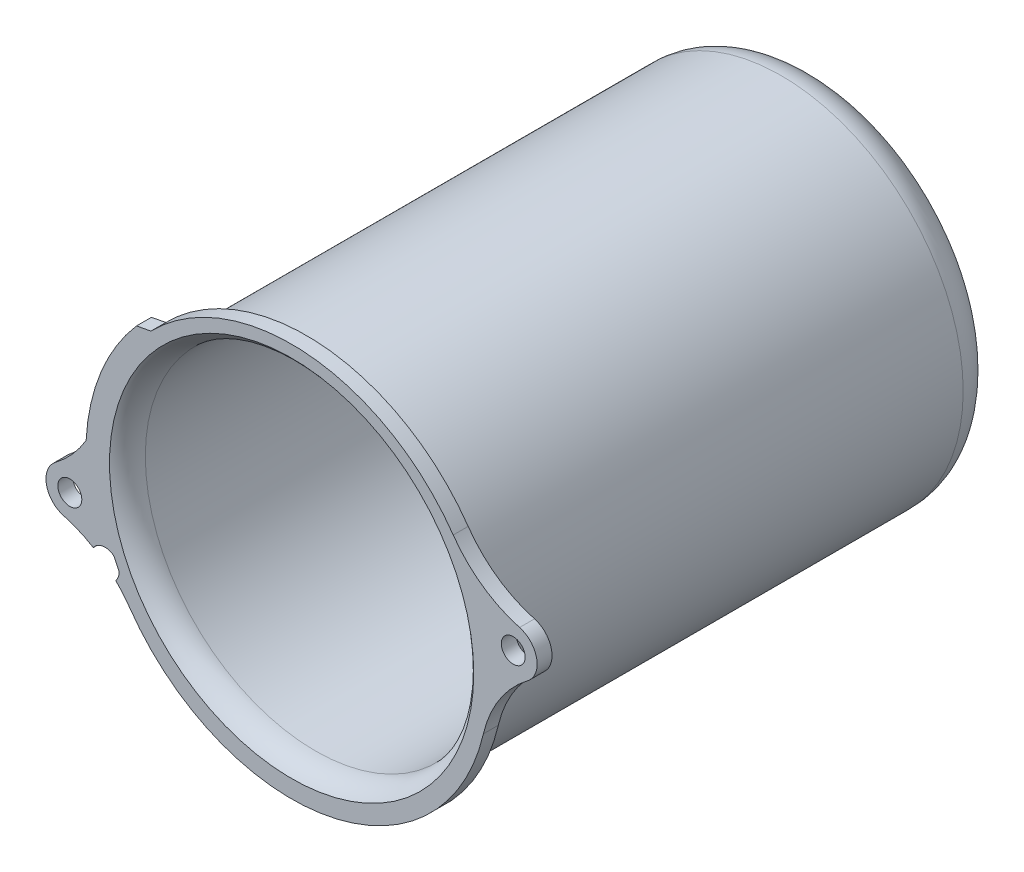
ISO-10303-21;
HEADER;
FILE_DESCRIPTION(('STEP AP214'),'2;1');
FILE_NAME('part.step','',(''),(''),'','','');
FILE_SCHEMA(('AUTOMOTIVE_DESIGN { 1 0 10303 214 1 1 1 1 }'));
ENDSEC;
DATA;
#1=APPLICATION_CONTEXT('core data for automotive mechanical design processes');
#2=APPLICATION_PROTOCOL_DEFINITION('international standard','automotive_design',2000,#1);
#3=PRODUCT_CONTEXT('',#1,'mechanical');
#4=PRODUCT('Part','Part','',(#3));
#5=PRODUCT_RELATED_PRODUCT_CATEGORY('part','',(#4));
#6=PRODUCT_DEFINITION_FORMATION('','',#4);
#7=PRODUCT_DEFINITION_CONTEXT('part definition',#1,'design');
#8=PRODUCT_DEFINITION('design','',#6,#7);
#9=PRODUCT_DEFINITION_SHAPE('','',#8);
#10=(LENGTH_UNIT() NAMED_UNIT(*) SI_UNIT(.MILLI.,.METRE.));
#11=(NAMED_UNIT(*) PLANE_ANGLE_UNIT() SI_UNIT($,.RADIAN.));
#12=(NAMED_UNIT(*) SI_UNIT($,.STERADIAN.) SOLID_ANGLE_UNIT());
#13=UNCERTAINTY_MEASURE_WITH_UNIT(LENGTH_MEASURE(1.E-05),#10,'distance_accuracy_value','');
#14=(GEOMETRIC_REPRESENTATION_CONTEXT(3) GLOBAL_UNCERTAINTY_ASSIGNED_CONTEXT((#13)) GLOBAL_UNIT_ASSIGNED_CONTEXT((#10,
#11,#12)) REPRESENTATION_CONTEXT('',''));
#15=CARTESIAN_POINT('',(0.,0.,0.));
#16=DIRECTION('',(0.,0.,1.));
#17=DIRECTION('',(1.,0.,0.));
#18=AXIS2_PLACEMENT_3D('',#15,#16,#17);
#19=CARTESIAN_POINT('',(37.1314984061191,7.1452296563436,0.));
#20=DIRECTION('',(0.,0.,1.));
#21=DIRECTION('',(1.,0.,0.));
#22=AXIS2_PLACEMENT_3D('',#19,#20,#21);
#23=PLANE('',#22);
#24=CARTESIAN_POINT('',(-37.1557425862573,-7.11096578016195,0.));
#25=DIRECTION('',(0.,0.,-1.));
#26=DIRECTION('',(-1.,0.,0.));
#27=AXIS2_PLACEMENT_3D('',#24,#25,#26);
#28=CIRCLE('',#27,2.);
#29=CARTESIAN_POINT('',(-39.1557425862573,-7.11096578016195,0.));
#30=VERTEX_POINT('',#29);
#31=EDGE_CURVE('E170',#30,#30,#28,.T.);
#32=ORIENTED_EDGE('',*,*,#31,.F.);
#33=EDGE_LOOP('',(#32));
#34=FACE_BOUND('',#33,.T.);
#35=CARTESIAN_POINT('',(37.1314984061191,7.1452296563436,0.));
#36=DIRECTION('',(0.,0.,1.));
#37=DIRECTION('',(1.,0.,0.));
#38=AXIS2_PLACEMENT_3D('',#35,#36,#37);
#39=CIRCLE('',#38,2.);
#40=CARTESIAN_POINT('',(39.1314984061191,7.1452296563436,0.));
#41=VERTEX_POINT('',#40);
#42=EDGE_CURVE('E158',#41,#41,#39,.T.);
#43=ORIENTED_EDGE('',*,*,#42,.T.);
#44=EDGE_LOOP('',(#43));
#45=FACE_BOUND('',#44,.T.);
#46=CARTESIAN_POINT('',(-31.2603609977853,-14.448814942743,0.));
#47=DIRECTION('',(0.,0.,1.));
#48=DIRECTION('',(1.,0.,0.));
#49=AXIS2_PLACEMENT_3D('',#46,#47,#48);
#50=CIRCLE('',#49,2.37047257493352);
#51=CARTESIAN_POINT('',(-29.4766622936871,-16.0100833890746,0.));
#52=VERTEX_POINT('',#51);
#53=CARTESIAN_POINT('',(-28.8900823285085,-14.4184956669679,0.));
#54=VERTEX_POINT('',#53);
#55=EDGE_CURVE('E196',#52,#54,#50,.T.);
#56=ORIENTED_EDGE('',*,*,#55,.T.);
#57=CARTESIAN_POINT('',(0.,0.490000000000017,0.));
#58=DIRECTION('',(0.,0.,1.));
#59=DIRECTION('',(1.,0.,0.));
#60=AXIS2_PLACEMENT_3D('',#57,#58,#59);
#61=CIRCLE('',#60,32.51);
#62=CARTESIAN_POINT('',(-29.7478317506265,-12.6236038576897,0.));
#63=VERTEX_POINT('',#62);
#64=EDGE_CURVE('E155',#63,#54,#61,.T.);
#65=ORIENTED_EDGE('',*,*,#64,.F.);
#66=CARTESIAN_POINT('',(-33.216253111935,-13.1095516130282,0.));
#67=VERTEX_POINT('',#66);
#68=EDGE_CURVE('E48',#63,#67,#50,.T.);
#69=ORIENTED_EDGE('',*,*,#68,.T.);
#70=CARTESIAN_POINT('',(-43.517994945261,-30.2523085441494,0.));
#71=DIRECTION('',(0.,0.,-1.));
#72=DIRECTION('',(-1.,0.,0.));
#73=AXIS2_PLACEMENT_3D('',#70,#71,#72);
#74=CIRCLE('',#73,20.);
#75=CARTESIAN_POINT('',(-38.2161179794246,-10.9678562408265,0.));
#76=VERTEX_POINT('',#75);
#77=EDGE_CURVE('E195',#76,#67,#74,.T.);
#78=ORIENTED_EDGE('',*,*,#77,.F.);
#79=CARTESIAN_POINT('',(-37.1557425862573,-7.11096578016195,0.));
#80=DIRECTION('',(0.,0.,-1.));
#81=DIRECTION('',(-1.,0.,0.));
#82=AXIS2_PLACEMENT_3D('',#79,#80,#81);
#83=CIRCLE('',#82,4.00000000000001);
#84=CARTESIAN_POINT('',(-39.5685318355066,-3.9205977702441,0.));
#85=VERTEX_POINT('',#84);
#86=EDGE_CURVE('E192',#76,#85,#83,.T.);
#87=ORIENTED_EDGE('',*,*,#86,.T.);
#88=CARTESIAN_POINT('',(-51.632478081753,12.0312422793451,0.));
#89=DIRECTION('',(0.,0.,1.));
#90=DIRECTION('',(1.,0.,0.));
#91=AXIS2_PLACEMENT_3D('',#88,#89,#90);
#92=CIRCLE('',#91,20.);
#93=CARTESIAN_POINT('',(-34.4270577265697,1.83450209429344,0.));
#94=VERTEX_POINT('',#93);
#95=EDGE_CURVE('E189',#85,#94,#92,.T.);
#96=ORIENTED_EDGE('',*,*,#95,.T.);
#97=CARTESIAN_POINT('',(-0.0121220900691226,0.0171319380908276,0.));
#98=DIRECTION('',(0.,0.,1.));
#99=DIRECTION('',(1.,0.,0.));
#100=AXIS2_PLACEMENT_3D('',#97,#98,#99);
#101=CIRCLE('',#100,34.4628877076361);
#102=CARTESIAN_POINT('',(-25.9858462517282,22.667877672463,0.));
#103=VERTEX_POINT('',#102);
#104=EDGE_CURVE('E186',#103,#94,#101,.T.);
#105=ORIENTED_EDGE('',*,*,#104,.F.);
#106=DIRECTION('',(-0.982414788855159,-0.186711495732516,0.));
#107=VECTOR('',#106,1.);
#108=CARTESIAN_POINT('',(-23.568944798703,23.1272185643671,0.));
#109=LINE('',#108,#107);
#110=CARTESIAN_POINT('',(-23.568944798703,23.1272185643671,0.));
#111=VERTEX_POINT('',#110);
#112=EDGE_CURVE('E183',#111,#103,#109,.T.);
#113=ORIENTED_EDGE('',*,*,#112,.F.);
#114=CARTESIAN_POINT('',(-0.0121220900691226,0.0171319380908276,0.));
#115=DIRECTION('',(0.,0.,1.));
#116=DIRECTION('',(1.,0.,0.));
#117=AXIS2_PLACEMENT_3D('',#114,#115,#116);
#118=CIRCLE('',#117,33.);
#119=CARTESIAN_POINT('',(27.0764402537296,18.8641420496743,0.));
#120=VERTEX_POINT('',#119);
#121=EDGE_CURVE('E182',#120,#111,#118,.T.);
#122=ORIENTED_EDGE('',*,*,#121,.F.);
#123=CARTESIAN_POINT('',(43.4937507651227,30.286572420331,0.));
#124=DIRECTION('',(0.,0.,-1.));
#125=DIRECTION('',(-1.,0.,0.));
#126=AXIS2_PLACEMENT_3D('',#123,#124,#125);
#127=CIRCLE('',#126,20.);
#128=CARTESIAN_POINT('',(38.1918737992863,11.0021201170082,0.));
#129=VERTEX_POINT('',#128);
#130=EDGE_CURVE('E179',#129,#120,#127,.T.);
#131=ORIENTED_EDGE('',*,*,#130,.F.);
#132=CARTESIAN_POINT('',(37.1314984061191,7.1452296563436,0.));
#133=DIRECTION('',(0.,0.,1.));
#134=DIRECTION('',(1.,0.,0.));
#135=AXIS2_PLACEMENT_3D('',#132,#133,#134);
#136=CIRCLE('',#135,4.00000000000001);
#137=CARTESIAN_POINT('',(39.5442876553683,3.95486164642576,0.));
#138=VERTEX_POINT('',#137);
#139=EDGE_CURVE('E176',#138,#129,#136,.T.);
#140=ORIENTED_EDGE('',*,*,#139,.F.);
#141=CARTESIAN_POINT('',(51.6082339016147,-11.9969784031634,0.));
#142=DIRECTION('',(0.,0.,1.));
#143=DIRECTION('',(1.,0.,0.));
#144=AXIS2_PLACEMENT_3D('',#141,#142,#143);
#145=CIRCLE('',#144,20.);
#146=CARTESIAN_POINT('',(32.1288542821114,-7.46335185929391,0.));
#147=VERTEX_POINT('',#146);
#148=EDGE_CURVE('E204',#138,#147,#145,.T.);
#149=ORIENTED_EDGE('',*,*,#148,.T.);
#150=CARTESIAN_POINT('',(-27.1006844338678,-18.8298781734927,0.));
#151=VERTEX_POINT('',#150);
#152=EDGE_CURVE('E201',#151,#147,#118,.T.);
#153=ORIENTED_EDGE('',*,*,#152,.F.);
#154=EDGE_CURVE('E198',#52,#151,#74,.T.);
#155=ORIENTED_EDGE('',*,*,#154,.F.);
#156=EDGE_LOOP('',(#56,#65,#69,#78,#87,#96,#105,#113,#122,#131,#140,#149,#153,#155));
#157=FACE_BOUND('',#156,.T.);
#158=CARTESIAN_POINT('',(0.,0.490000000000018,0.));
#159=DIRECTION('',(0.,0.,1.));
#160=DIRECTION('',(1.,0.,0.));
#161=AXIS2_PLACEMENT_3D('',#158,#159,#160);
#162=CIRCLE('',#161,32.01);
#163=CARTESIAN_POINT('',(32.01,0.490000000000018,0.));
#164=VERTEX_POINT('',#163);
#165=EDGE_CURVE('E11',#164,#164,#162,.F.);
#166=ORIENTED_EDGE('',*,*,#165,.F.);
#167=EDGE_LOOP('',(#166));
#168=FACE_BOUND('',#167,.T.);
#169=ADVANCED_FACE('F33',(#34,#45,#157,#168),#23,.F.);
#170=CARTESIAN_POINT('',(-31.2603609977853,-14.448814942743,2.5));
#171=DIRECTION('',(0.,0.,-1.));
#172=DIRECTION('',(-1.,0.,0.));
#173=AXIS2_PLACEMENT_3D('',#170,#171,#172);
#174=CYLINDRICAL_SURFACE('',#173,2.37047257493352);
#175=CARTESIAN_POINT('',(-31.2603609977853,-14.448814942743,2.5));
#176=DIRECTION('',(0.,0.,1.));
#177=DIRECTION('',(1.,0.,0.));
#178=AXIS2_PLACEMENT_3D('',#175,#176,#177);
#179=CIRCLE('',#178,2.37047257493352);
#180=CARTESIAN_POINT('',(-29.4766622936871,-16.0100833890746,2.5));
#181=VERTEX_POINT('',#180);
#182=CARTESIAN_POINT('',(-28.8900823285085,-14.4184956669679,2.5));
#183=VERTEX_POINT('',#182);
#184=EDGE_CURVE('E145',#181,#183,#179,.T.);
#185=ORIENTED_EDGE('',*,*,#184,.T.);
#186=DIRECTION('',(0.,0.,1.));
#187=VECTOR('',#186,1.);
#188=CARTESIAN_POINT('',(-28.8900823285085,-14.4184956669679,1.24999999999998));
#189=LINE('',#188,#187);
#190=EDGE_CURVE('E41',#183,#54,#189,.F.);
#191=ORIENTED_EDGE('',*,*,#190,.T.);
#192=ORIENTED_EDGE('',*,*,#55,.F.);
#193=DIRECTION('',(0.,0.,-1.));
#194=VECTOR('',#193,1.);
#195=CARTESIAN_POINT('',(-29.4766622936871,-16.0100833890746,2.5));
#196=LINE('',#195,#194);
#197=EDGE_CURVE('E241',#181,#52,#196,.T.);
#198=ORIENTED_EDGE('',*,*,#197,.F.);
#199=EDGE_LOOP('',(#185,#191,#192,#198));
#200=FACE_BOUND('',#199,.T.);
#201=ADVANCED_FACE('F287',(#200),#174,.F.);
#202=ORIENTED_EDGE('',*,*,#68,.F.);
#203=DIRECTION('',(0.,0.,1.));
#204=VECTOR('',#203,1.);
#205=CARTESIAN_POINT('',(-29.7478317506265,-12.6236038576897,1.24999999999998));
#206=LINE('',#205,#204);
#207=CARTESIAN_POINT('',(-29.7478317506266,-12.6236038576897,2.49999999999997));
#208=VERTEX_POINT('',#207);
#209=EDGE_CURVE('E147',#63,#208,#206,.T.);
#210=ORIENTED_EDGE('',*,*,#209,.T.);
#211=CARTESIAN_POINT('',(-33.216253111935,-13.1095516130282,2.5));
#212=VERTEX_POINT('',#211);
#213=EDGE_CURVE('E135',#208,#212,#179,.T.);
#214=ORIENTED_EDGE('',*,*,#213,.T.);
#215=DIRECTION('',(0.,0.,-1.));
#216=VECTOR('',#215,1.);
#217=CARTESIAN_POINT('',(-33.216253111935,-13.1095516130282,2.5));
#218=LINE('',#217,#216);
#219=EDGE_CURVE('E243',#212,#67,#218,.T.);
#220=ORIENTED_EDGE('',*,*,#219,.T.);
#221=EDGE_LOOP('',(#202,#210,#214,#220));
#222=FACE_BOUND('',#221,.T.);
#223=ADVANCED_FACE('F148',(#222),#174,.F.);
#224=CARTESIAN_POINT('',(37.1314984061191,7.1452296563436,2.5));
#225=DIRECTION('',(0.,0.,1.));
#226=DIRECTION('',(1.,0.,0.));
#227=AXIS2_PLACEMENT_3D('',#224,#225,#226);
#228=PLANE('',#227);
#229=CARTESIAN_POINT('',(0.,0.490000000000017,2.49999999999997));
#230=DIRECTION('',(0.,0.,1.));
#231=DIRECTION('',(1.,0.,0.));
#232=AXIS2_PLACEMENT_3D('',#229,#230,#231);
#233=CIRCLE('',#232,32.51);
#234=EDGE_CURVE('E140',#208,#183,#233,.T.);
#235=ORIENTED_EDGE('',*,*,#234,.T.);
#236=ORIENTED_EDGE('',*,*,#184,.F.);
#237=CARTESIAN_POINT('',(-43.517994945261,-30.2523085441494,2.5));
#238=DIRECTION('',(0.,0.,-1.));
#239=DIRECTION('',(-1.,0.,0.));
#240=AXIS2_PLACEMENT_3D('',#237,#238,#239);
#241=CIRCLE('',#240,20.);
#242=CARTESIAN_POINT('',(-27.1006844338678,-18.8298781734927,2.5));
#243=VERTEX_POINT('',#242);
#244=EDGE_CURVE('E226',#181,#243,#241,.T.);
#245=ORIENTED_EDGE('',*,*,#244,.T.);
#246=CARTESIAN_POINT('',(-0.0121220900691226,0.0171319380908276,2.5));
#247=DIRECTION('',(0.,0.,1.));
#248=DIRECTION('',(1.,0.,0.));
#249=AXIS2_PLACEMENT_3D('',#246,#247,#248);
#250=CIRCLE('',#249,33.);
#251=CARTESIAN_POINT('',(32.1288542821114,-7.46335185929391,2.5));
#252=VERTEX_POINT('',#251);
#253=EDGE_CURVE('E229',#243,#252,#250,.T.);
#254=ORIENTED_EDGE('',*,*,#253,.T.);
#255=CARTESIAN_POINT('',(51.6082339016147,-11.9969784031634,2.5));
#256=DIRECTION('',(0.,0.,1.));
#257=DIRECTION('',(1.,0.,0.));
#258=AXIS2_PLACEMENT_3D('',#255,#256,#257);
#259=CIRCLE('',#258,20.);
#260=CARTESIAN_POINT('',(39.5442876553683,3.95486164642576,2.5));
#261=VERTEX_POINT('',#260);
#262=EDGE_CURVE('E232',#261,#252,#259,.T.);
#263=ORIENTED_EDGE('',*,*,#262,.F.);
#264=CARTESIAN_POINT('',(37.1314984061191,7.1452296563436,2.5));
#265=DIRECTION('',(0.,0.,1.));
#266=DIRECTION('',(1.,0.,0.));
#267=AXIS2_PLACEMENT_3D('',#264,#265,#266);
#268=CIRCLE('',#267,4.00000000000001);
#269=CARTESIAN_POINT('',(38.1918737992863,11.0021201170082,2.5));
#270=VERTEX_POINT('',#269);
#271=EDGE_CURVE('E207',#261,#270,#268,.T.);
#272=ORIENTED_EDGE('',*,*,#271,.T.);
#273=CARTESIAN_POINT('',(43.4937507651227,30.286572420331,2.5));
#274=DIRECTION('',(0.,0.,-1.));
#275=DIRECTION('',(-1.,0.,0.));
#276=AXIS2_PLACEMENT_3D('',#273,#274,#275);
#277=CIRCLE('',#276,20.);
#278=CARTESIAN_POINT('',(27.0764402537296,18.8641420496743,2.5));
#279=VERTEX_POINT('',#278);
#280=EDGE_CURVE('E210',#270,#279,#277,.T.);
#281=ORIENTED_EDGE('',*,*,#280,.T.);
#282=CARTESIAN_POINT('',(-23.568944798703,23.1272185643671,2.5));
#283=VERTEX_POINT('',#282);
#284=EDGE_CURVE('E213',#279,#283,#250,.T.);
#285=ORIENTED_EDGE('',*,*,#284,.T.);
#286=DIRECTION('',(-0.982414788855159,-0.186711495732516,0.));
#287=VECTOR('',#286,1.);
#288=CARTESIAN_POINT('',(-23.568944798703,23.1272185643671,2.5));
#289=LINE('',#288,#287);
#290=CARTESIAN_POINT('',(-25.9858462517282,22.667877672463,2.5));
#291=VERTEX_POINT('',#290);
#292=EDGE_CURVE('E214',#283,#291,#289,.T.);
#293=ORIENTED_EDGE('',*,*,#292,.T.);
#294=CARTESIAN_POINT('',(-0.0121220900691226,0.0171319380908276,2.5));
#295=DIRECTION('',(0.,0.,1.));
#296=DIRECTION('',(1.,0.,0.));
#297=AXIS2_PLACEMENT_3D('',#294,#295,#296);
#298=CIRCLE('',#297,34.4628877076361);
#299=CARTESIAN_POINT('',(-34.4270577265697,1.83450209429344,2.5));
#300=VERTEX_POINT('',#299);
#301=EDGE_CURVE('E217',#291,#300,#298,.T.);
#302=ORIENTED_EDGE('',*,*,#301,.T.);
#303=CARTESIAN_POINT('',(-51.632478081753,12.0312422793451,2.5));
#304=DIRECTION('',(0.,0.,1.));
#305=DIRECTION('',(1.,0.,0.));
#306=AXIS2_PLACEMENT_3D('',#303,#304,#305);
#307=CIRCLE('',#306,20.);
#308=CARTESIAN_POINT('',(-39.5685318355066,-3.9205977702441,2.5));
#309=VERTEX_POINT('',#308);
#310=EDGE_CURVE('E220',#309,#300,#307,.T.);
#311=ORIENTED_EDGE('',*,*,#310,.F.);
#312=CARTESIAN_POINT('',(-37.1557425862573,-7.11096578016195,2.5));
#313=DIRECTION('',(0.,0.,-1.));
#314=DIRECTION('',(-1.,0.,0.));
#315=AXIS2_PLACEMENT_3D('',#312,#313,#314);
#316=CIRCLE('',#315,4.00000000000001);
#317=CARTESIAN_POINT('',(-38.2161179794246,-10.9678562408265,2.5));
#318=VERTEX_POINT('',#317);
#319=EDGE_CURVE('E223',#318,#309,#316,.T.);
#320=ORIENTED_EDGE('',*,*,#319,.F.);
#321=EDGE_CURVE('E143',#318,#212,#241,.T.);
#322=ORIENTED_EDGE('',*,*,#321,.T.);
#323=ORIENTED_EDGE('',*,*,#213,.F.);
#324=EDGE_LOOP('',(#235,#236,#245,#254,#263,#272,#281,#285,#293,#302,#311,#320,#322,#323));
#325=FACE_BOUND('',#324,.T.);
#326=CARTESIAN_POINT('',(0.,0.490000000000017,2.49999999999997));
#327=DIRECTION('',(0.,0.,1.));
#328=DIRECTION('',(1.,0.,0.));
#329=AXIS2_PLACEMENT_3D('',#326,#327,#328);
#330=CIRCLE('',#329,30.51);
#331=CARTESIAN_POINT('',(30.51,0.490000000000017,2.49999999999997));
#332=VERTEX_POINT('',#331);
#333=EDGE_CURVE('E156',#332,#332,#330,.T.);
#334=ORIENTED_EDGE('',*,*,#333,.F.);
#335=EDGE_LOOP('',(#334));
#336=FACE_BOUND('',#335,.T.);
#337=CARTESIAN_POINT('',(-37.1557425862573,-7.11096578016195,2.5));
#338=DIRECTION('',(0.,0.,-1.));
#339=DIRECTION('',(-1.,0.,0.));
#340=AXIS2_PLACEMENT_3D('',#337,#338,#339);
#341=CIRCLE('',#340,2.);
#342=CARTESIAN_POINT('',(-39.1557425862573,-7.11096578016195,2.5));
#343=VERTEX_POINT('',#342);
#344=EDGE_CURVE('E173',#343,#343,#341,.T.);
#345=ORIENTED_EDGE('',*,*,#344,.T.);
#346=EDGE_LOOP('',(#345));
#347=FACE_BOUND('',#346,.T.);
#348=CARTESIAN_POINT('',(37.1314984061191,7.1452296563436,2.5));
#349=DIRECTION('',(0.,0.,1.));
#350=DIRECTION('',(1.,0.,0.));
#351=AXIS2_PLACEMENT_3D('',#348,#349,#350);
#352=CIRCLE('',#351,2.);
#353=CARTESIAN_POINT('',(39.1314984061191,7.1452296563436,2.5));
#354=VERTEX_POINT('',#353);
#355=EDGE_CURVE('E167',#354,#354,#352,.T.);
#356=ORIENTED_EDGE('',*,*,#355,.F.);
#357=EDGE_LOOP('',(#356));
#358=FACE_BOUND('',#357,.T.);
#359=ADVANCED_FACE('F136',(#325,#336,#347,#358),#228,.T.);
#360=CARTESIAN_POINT('',(37.1314984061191,7.1452296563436,2.5));
#361=DIRECTION('',(0.,0.,-1.));
#362=DIRECTION('',(-1.,0.,0.));
#363=AXIS2_PLACEMENT_3D('',#360,#361,#362);
#364=CYLINDRICAL_SURFACE('',#363,4.00000000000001);
#365=DIRECTION('',(0.,0.,-1.));
#366=VECTOR('',#365,1.);
#367=CARTESIAN_POINT('',(38.1918737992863,11.0021201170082,2.5));
#368=LINE('',#367,#366);
#369=EDGE_CURVE('E152',#270,#129,#368,.T.);
#370=ORIENTED_EDGE('',*,*,#369,.F.);
#371=ORIENTED_EDGE('',*,*,#271,.F.);
#372=DIRECTION('',(0.,0.,-1.));
#373=VECTOR('',#372,1.);
#374=CARTESIAN_POINT('',(39.5442876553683,3.95486164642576,2.5));
#375=LINE('',#374,#373);
#376=EDGE_CURVE('E235',#261,#138,#375,.T.);
#377=ORIENTED_EDGE('',*,*,#376,.T.);
#378=ORIENTED_EDGE('',*,*,#139,.T.);
#379=EDGE_LOOP('',(#370,#371,#377,#378));
#380=FACE_BOUND('',#379,.T.);
#381=ADVANCED_FACE('F264',(#380),#364,.T.);
#382=CARTESIAN_POINT('',(43.4937507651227,30.286572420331,2.5));
#383=DIRECTION('',(0.,0.,-1.));
#384=DIRECTION('',(-1.,0.,0.));
#385=AXIS2_PLACEMENT_3D('',#382,#383,#384);
#386=CYLINDRICAL_SURFACE('',#385,20.);
#387=DIRECTION('',(0.,0.,-1.));
#388=VECTOR('',#387,1.);
#389=CARTESIAN_POINT('',(27.0764402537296,18.8641420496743,2.5));
#390=LINE('',#389,#388);
#391=EDGE_CURVE('E255',#279,#120,#390,.T.);
#392=ORIENTED_EDGE('',*,*,#391,.F.);
#393=ORIENTED_EDGE('',*,*,#280,.F.);
#394=ORIENTED_EDGE('',*,*,#369,.T.);
#395=ORIENTED_EDGE('',*,*,#130,.T.);
#396=EDGE_LOOP('',(#392,#393,#394,#395));
#397=FACE_BOUND('',#396,.T.);
#398=ADVANCED_FACE('F35',(#397),#386,.F.);
#399=CARTESIAN_POINT('',(-0.0121220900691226,0.0171319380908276,2.5));
#400=DIRECTION('',(0.,0.,-1.));
#401=DIRECTION('',(-1.,0.,0.));
#402=AXIS2_PLACEMENT_3D('',#399,#400,#401);
#403=CYLINDRICAL_SURFACE('',#402,33.);
#404=DIRECTION('',(0.,0.,-1.));
#405=VECTOR('',#404,1.);
#406=CARTESIAN_POINT('',(-23.568944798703,23.1272185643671,2.5));
#407=LINE('',#406,#405);
#408=EDGE_CURVE('E253',#283,#111,#407,.T.);
#409=ORIENTED_EDGE('',*,*,#408,.F.);
#410=ORIENTED_EDGE('',*,*,#284,.F.);
#411=ORIENTED_EDGE('',*,*,#391,.T.);
#412=ORIENTED_EDGE('',*,*,#121,.T.);
#413=EDGE_LOOP('',(#409,#410,#411,#412));
#414=FACE_BOUND('',#413,.T.);
#415=ADVANCED_FACE('F272',(#414),#403,.T.);
#416=CARTESIAN_POINT('',(-23.568944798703,23.1272185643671,2.5));
#417=DIRECTION('',(0.186711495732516,-0.982414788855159,0.));
#418=DIRECTION('',(0.982414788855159,0.186711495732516,0.));
#419=AXIS2_PLACEMENT_3D('',#416,#417,#418);
#420=PLANE('',#419);
#421=DIRECTION('',(0.,0.,-1.));
#422=VECTOR('',#421,1.);
#423=CARTESIAN_POINT('',(-25.9858462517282,22.667877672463,2.5));
#424=LINE('',#423,#422);
#425=EDGE_CURVE('E251',#291,#103,#424,.T.);
#426=ORIENTED_EDGE('',*,*,#425,.F.);
#427=ORIENTED_EDGE('',*,*,#292,.F.);
#428=ORIENTED_EDGE('',*,*,#408,.T.);
#429=ORIENTED_EDGE('',*,*,#112,.T.);
#430=EDGE_LOOP('',(#426,#427,#428,#429));
#431=FACE_BOUND('',#430,.T.);
#432=ADVANCED_FACE('F303',(#431),#420,.F.);
#433=CARTESIAN_POINT('',(-0.0121220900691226,0.0171319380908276,2.5));
#434=DIRECTION('',(0.,0.,-1.));
#435=DIRECTION('',(-1.,0.,0.));
#436=AXIS2_PLACEMENT_3D('',#433,#434,#435);
#437=CYLINDRICAL_SURFACE('',#436,34.4628877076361);
#438=DIRECTION('',(0.,0.,-1.));
#439=VECTOR('',#438,1.);
#440=CARTESIAN_POINT('',(-34.4270577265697,1.83450209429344,2.5));
#441=LINE('',#440,#439);
#442=EDGE_CURVE('E249',#300,#94,#441,.T.);
#443=ORIENTED_EDGE('',*,*,#442,.F.);
#444=ORIENTED_EDGE('',*,*,#301,.F.);
#445=ORIENTED_EDGE('',*,*,#425,.T.);
#446=ORIENTED_EDGE('',*,*,#104,.T.);
#447=EDGE_LOOP('',(#443,#444,#445,#446));
#448=FACE_BOUND('',#447,.T.);
#449=ADVANCED_FACE('F301',(#448),#437,.T.);
#450=CARTESIAN_POINT('',(-51.632478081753,12.0312422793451,2.5));
#451=DIRECTION('',(0.,0.,-1.));
#452=DIRECTION('',(-1.,0.,0.));
#453=AXIS2_PLACEMENT_3D('',#450,#451,#452);
#454=CYLINDRICAL_SURFACE('',#453,20.);
#455=DIRECTION('',(0.,0.,-1.));
#456=VECTOR('',#455,1.);
#457=CARTESIAN_POINT('',(-39.5685318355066,-3.9205977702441,2.5));
#458=LINE('',#457,#456);
#459=EDGE_CURVE('E247',#309,#85,#458,.T.);
#460=ORIENTED_EDGE('',*,*,#459,.F.);
#461=ORIENTED_EDGE('',*,*,#310,.T.);
#462=ORIENTED_EDGE('',*,*,#442,.T.);
#463=ORIENTED_EDGE('',*,*,#95,.F.);
#464=EDGE_LOOP('',(#460,#461,#462,#463));
#465=FACE_BOUND('',#464,.T.);
#466=ADVANCED_FACE('F297',(#465),#454,.F.);
#467=CARTESIAN_POINT('',(-37.1557425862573,-7.11096578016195,2.5));
#468=DIRECTION('',(0.,0.,-1.));
#469=DIRECTION('',(-1.,0.,0.));
#470=AXIS2_PLACEMENT_3D('',#467,#468,#469);
#471=CYLINDRICAL_SURFACE('',#470,4.00000000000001);
#472=DIRECTION('',(0.,0.,-1.));
#473=VECTOR('',#472,1.);
#474=CARTESIAN_POINT('',(-38.2161179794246,-10.9678562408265,2.5));
#475=LINE('',#474,#473);
#476=EDGE_CURVE('E245',#318,#76,#475,.T.);
#477=ORIENTED_EDGE('',*,*,#476,.F.);
#478=ORIENTED_EDGE('',*,*,#319,.T.);
#479=ORIENTED_EDGE('',*,*,#459,.T.);
#480=ORIENTED_EDGE('',*,*,#86,.F.);
#481=EDGE_LOOP('',(#477,#478,#479,#480));
#482=FACE_BOUND('',#481,.T.);
#483=ADVANCED_FACE('F294',(#482),#471,.T.);
#484=CARTESIAN_POINT('',(-43.517994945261,-30.2523085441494,2.5));
#485=DIRECTION('',(0.,0.,-1.));
#486=DIRECTION('',(-1.,0.,0.));
#487=AXIS2_PLACEMENT_3D('',#484,#485,#486);
#488=CYLINDRICAL_SURFACE('',#487,20.);
#489=ORIENTED_EDGE('',*,*,#219,.F.);
#490=ORIENTED_EDGE('',*,*,#321,.F.);
#491=ORIENTED_EDGE('',*,*,#476,.T.);
#492=ORIENTED_EDGE('',*,*,#77,.T.);
#493=EDGE_LOOP('',(#489,#490,#491,#492));
#494=FACE_BOUND('',#493,.T.);
#495=ADVANCED_FACE('F291',(#494),#488,.F.);
#496=DIRECTION('',(0.,0.,-1.));
#497=VECTOR('',#496,1.);
#498=CARTESIAN_POINT('',(-27.1006844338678,-18.8298781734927,2.5));
#499=LINE('',#498,#497);
#500=EDGE_CURVE('E239',#243,#151,#499,.T.);
#501=ORIENTED_EDGE('',*,*,#500,.F.);
#502=ORIENTED_EDGE('',*,*,#244,.F.);
#503=ORIENTED_EDGE('',*,*,#197,.T.);
#504=ORIENTED_EDGE('',*,*,#154,.T.);
#505=EDGE_LOOP('',(#501,#502,#503,#504));
#506=FACE_BOUND('',#505,.T.);
#507=ADVANCED_FACE('F286',(#506),#488,.F.);
#508=DIRECTION('',(0.,0.,-1.));
#509=VECTOR('',#508,1.);
#510=CARTESIAN_POINT('',(32.1288542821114,-7.46335185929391,2.5));
#511=LINE('',#510,#509);
#512=EDGE_CURVE('E237',#252,#147,#511,.T.);
#513=ORIENTED_EDGE('',*,*,#512,.F.);
#514=ORIENTED_EDGE('',*,*,#253,.F.);
#515=ORIENTED_EDGE('',*,*,#500,.T.);
#516=ORIENTED_EDGE('',*,*,#152,.T.);
#517=EDGE_LOOP('',(#513,#514,#515,#516));
#518=FACE_BOUND('',#517,.T.);
#519=ADVANCED_FACE('F283',(#518),#403,.T.);
#520=CARTESIAN_POINT('',(51.6082339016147,-11.9969784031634,2.5));
#521=DIRECTION('',(0.,0.,-1.));
#522=DIRECTION('',(-1.,0.,0.));
#523=AXIS2_PLACEMENT_3D('',#520,#521,#522);
#524=CYLINDRICAL_SURFACE('',#523,20.);
#525=ORIENTED_EDGE('',*,*,#262,.T.);
#526=ORIENTED_EDGE('',*,*,#512,.T.);
#527=ORIENTED_EDGE('',*,*,#148,.F.);
#528=ORIENTED_EDGE('',*,*,#376,.F.);
#529=EDGE_LOOP('',(#525,#526,#527,#528));
#530=FACE_BOUND('',#529,.T.);
#531=ADVANCED_FACE('F279',(#530),#524,.F.);
#532=CARTESIAN_POINT('',(-37.1557425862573,-7.11096578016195,2.5));
#533=DIRECTION('',(0.,0.,-1.));
#534=DIRECTION('',(-1.,0.,0.));
#535=AXIS2_PLACEMENT_3D('',#532,#533,#534);
#536=CYLINDRICAL_SURFACE('',#535,2.);
#537=ORIENTED_EDGE('',*,*,#344,.F.);
#538=EDGE_LOOP('',(#537));
#539=FACE_BOUND('',#538,.T.);
#540=ORIENTED_EDGE('',*,*,#31,.T.);
#541=EDGE_LOOP('',(#540));
#542=FACE_BOUND('',#541,.T.);
#543=ADVANCED_FACE('F322',(#539,#542),#536,.F.);
#544=CARTESIAN_POINT('',(37.1314984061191,7.1452296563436,2.5));
#545=DIRECTION('',(0.,0.,-1.));
#546=DIRECTION('',(-1.,0.,0.));
#547=AXIS2_PLACEMENT_3D('',#544,#545,#546);
#548=CYLINDRICAL_SURFACE('',#547,2.);
#549=ORIENTED_EDGE('',*,*,#355,.T.);
#550=EDGE_LOOP('',(#549));
#551=FACE_BOUND('',#550,.T.);
#552=ORIENTED_EDGE('',*,*,#42,.F.);
#553=EDGE_LOOP('',(#552));
#554=FACE_BOUND('',#553,.T.);
#555=ADVANCED_FACE('F367',(#551,#554),#548,.F.);
#556=CARTESIAN_POINT('',(0.,0.490000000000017,-0.231281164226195));
#557=DIRECTION('',(0.,0.,1.));
#558=DIRECTION('',(1.,0.,0.));
#559=AXIS2_PLACEMENT_3D('',#556,#557,#558);
#560=CYLINDRICAL_SURFACE('',#559,30.5099999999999);
#561=CARTESIAN_POINT('',(0.,0.490000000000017,-79.4999999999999));
#562=DIRECTION('',(0.,0.,1.));
#563=DIRECTION('',(1.,0.,0.));
#564=AXIS2_PLACEMENT_3D('',#561,#562,#563);
#565=CIRCLE('',#564,30.51);
#566=CARTESIAN_POINT('',(30.51,0.490000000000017,-79.4999999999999));
#567=VERTEX_POINT('',#566);
#568=EDGE_CURVE('E644',#567,#567,#565,.T.);
#569=ORIENTED_EDGE('',*,*,#568,.T.);
#570=EDGE_LOOP('',(#569));
#571=FACE_BOUND('',#570,.T.);
#572=CARTESIAN_POINT('',(0.,0.490000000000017,-1.49999999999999));
#573=DIRECTION('',(0.,0.,1.));
#574=DIRECTION('',(1.,0.,0.));
#575=AXIS2_PLACEMENT_3D('',#572,#573,#574);
#576=CIRCLE('',#575,30.5099999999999);
#577=CARTESIAN_POINT('',(30.5099999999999,0.490000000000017,-1.49999999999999));
#578=VERTEX_POINT('',#577);
#579=EDGE_CURVE('E641',#578,#578,#576,.T.);
#580=ORIENTED_EDGE('',*,*,#579,.F.);
#581=EDGE_LOOP('',(#580));
#582=FACE_BOUND('',#581,.T.);
#583=ADVANCED_FACE('F374',(#571,#582),#560,.T.);
#584=CARTESIAN_POINT('',(0.,0.490000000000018,-79.5));
#585=DIRECTION('',(0.,0.,1.));
#586=DIRECTION('',(1.,0.,0.));
#587=AXIS2_PLACEMENT_3D('',#584,#585,#586);
#588=TOROIDAL_SURFACE('',#587,24.5099999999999,6.);
#589=ORIENTED_EDGE('',*,*,#568,.F.);
#590=EDGE_LOOP('',(#589));
#591=FACE_BOUND('',#590,.T.);
#592=CARTESIAN_POINT('',(0.,0.490000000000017,-85.5));
#593=DIRECTION('',(0.,0.,1.));
#594=DIRECTION('',(1.,0.,0.));
#595=AXIS2_PLACEMENT_3D('',#592,#593,#594);
#596=CIRCLE('',#595,24.5099999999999);
#597=CARTESIAN_POINT('',(24.5099999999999,0.490000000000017,-85.5));
#598=VERTEX_POINT('',#597);
#599=EDGE_CURVE('E647',#598,#598,#596,.T.);
#600=ORIENTED_EDGE('',*,*,#599,.T.);
#601=EDGE_LOOP('',(#600));
#602=FACE_BOUND('',#601,.T.);
#603=ADVANCED_FACE('F381',(#591,#602),#588,.T.);
#604=CARTESIAN_POINT('',(0.,24.9999999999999,-85.5));
#605=DIRECTION('',(0.,0.,-1.));
#606=DIRECTION('',(-1.,0.,0.));
#607=AXIS2_PLACEMENT_3D('',#604,#605,#606);
#608=PLANE('',#607);
#609=CARTESIAN_POINT('',(0.,0.490000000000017,-85.5));
#610=DIRECTION('',(0.,0.,1.));
#611=DIRECTION('',(1.,0.,0.));
#612=AXIS2_PLACEMENT_3D('',#609,#610,#611);
#613=CIRCLE('',#612,13.01);
#614=CARTESIAN_POINT('',(13.01,0.490000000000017,-85.5));
#615=VERTEX_POINT('',#614);
#616=EDGE_CURVE('E652',#615,#615,#613,.T.);
#617=ORIENTED_EDGE('',*,*,#616,.T.);
#618=EDGE_LOOP('',(#617));
#619=FACE_BOUND('',#618,.T.);
#620=ORIENTED_EDGE('',*,*,#599,.F.);
#621=EDGE_LOOP('',(#620));
#622=FACE_BOUND('',#621,.T.);
#623=ADVANCED_FACE('F389',(#619,#622),#608,.T.);
#624=CARTESIAN_POINT('',(0.,0.490000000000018,-86.5));
#625=DIRECTION('',(0.,0.,1.));
#626=DIRECTION('',(1.,0.,0.));
#627=AXIS2_PLACEMENT_3D('',#624,#625,#626);
#628=TOROIDAL_SURFACE('',#627,13.01,0.999999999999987);
#629=ORIENTED_EDGE('',*,*,#616,.F.);
#630=EDGE_LOOP('',(#629));
#631=FACE_BOUND('',#630,.T.);
#632=CARTESIAN_POINT('',(0.,0.490000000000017,-86.5));
#633=DIRECTION('',(0.,0.,1.));
#634=DIRECTION('',(1.,0.,0.));
#635=AXIS2_PLACEMENT_3D('',#632,#633,#634);
#636=CIRCLE('',#635,12.01);
#637=CARTESIAN_POINT('',(12.01,0.490000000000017,-86.5));
#638=VERTEX_POINT('',#637);
#639=EDGE_CURVE('E655',#638,#638,#636,.T.);
#640=ORIENTED_EDGE('',*,*,#639,.T.);
#641=EDGE_LOOP('',(#640));
#642=FACE_BOUND('',#641,.T.);
#643=ADVANCED_FACE('F397',(#631,#642),#628,.F.);
#644=CARTESIAN_POINT('',(0.,0.490000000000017,-0.231281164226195));
#645=DIRECTION('',(0.,0.,1.));
#646=DIRECTION('',(1.,0.,0.));
#647=AXIS2_PLACEMENT_3D('',#644,#645,#646);
#648=CYLINDRICAL_SURFACE('',#647,12.01);
#649=CARTESIAN_POINT('',(0.,0.490000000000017,-90.4999999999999));
#650=DIRECTION('',(0.,0.,1.));
#651=DIRECTION('',(1.,0.,0.));
#652=AXIS2_PLACEMENT_3D('',#649,#650,#651);
#653=CIRCLE('',#652,12.01);
#654=CARTESIAN_POINT('',(12.01,0.490000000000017,-90.4999999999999));
#655=VERTEX_POINT('',#654);
#656=EDGE_CURVE('E658',#655,#655,#653,.T.);
#657=ORIENTED_EDGE('',*,*,#656,.T.);
#658=EDGE_LOOP('',(#657));
#659=FACE_BOUND('',#658,.T.);
#660=ORIENTED_EDGE('',*,*,#639,.F.);
#661=EDGE_LOOP('',(#660));
#662=FACE_BOUND('',#661,.T.);
#663=ADVANCED_FACE('F405',(#659,#662),#648,.T.);
#664=CARTESIAN_POINT('',(0.,0.490000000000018,-90.5));
#665=DIRECTION('',(0.,0.,1.));
#666=DIRECTION('',(1.,0.,0.));
#667=AXIS2_PLACEMENT_3D('',#664,#665,#666);
#668=TOROIDAL_SURFACE('',#667,8.00999999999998,3.99999999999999);
#669=ORIENTED_EDGE('',*,*,#656,.F.);
#670=EDGE_LOOP('',(#669));
#671=FACE_BOUND('',#670,.T.);
#672=CARTESIAN_POINT('',(0.,0.490000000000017,-94.5));
#673=DIRECTION('',(0.,0.,1.));
#674=DIRECTION('',(1.,0.,0.));
#675=AXIS2_PLACEMENT_3D('',#672,#673,#674);
#676=CIRCLE('',#675,8.00999999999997);
#677=CARTESIAN_POINT('',(8.00999999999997,0.490000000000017,-94.5));
#678=VERTEX_POINT('',#677);
#679=EDGE_CURVE('E661',#678,#678,#676,.T.);
#680=ORIENTED_EDGE('',*,*,#679,.T.);
#681=EDGE_LOOP('',(#680));
#682=FACE_BOUND('',#681,.T.);
#683=ADVANCED_FACE('F413',(#671,#682),#668,.T.);
#684=CARTESIAN_POINT('',(0.,8.49999999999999,-94.5));
#685=DIRECTION('',(0.,0.,-1.));
#686=DIRECTION('',(-1.,0.,0.));
#687=AXIS2_PLACEMENT_3D('',#684,#685,#686);
#688=PLANE('',#687);
#689=CARTESIAN_POINT('',(0.,0.490000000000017,-94.4999999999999));
#690=DIRECTION('',(0.,0.,1.));
#691=DIRECTION('',(1.,0.,0.));
#692=AXIS2_PLACEMENT_3D('',#689,#690,#691);
#693=CIRCLE('',#692,0.00999999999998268);
#694=CARTESIAN_POINT('',(0.00999999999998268,0.490000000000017,-94.4999999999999));
#695=VERTEX_POINT('',#694);
#696=EDGE_CURVE('E664',#695,#695,#693,.T.);
#697=ORIENTED_EDGE('',*,*,#696,.T.);
#698=EDGE_LOOP('',(#697));
#699=FACE_BOUND('',#698,.T.);
#700=ORIENTED_EDGE('',*,*,#679,.F.);
#701=EDGE_LOOP('',(#700));
#702=FACE_BOUND('',#701,.T.);
#703=ADVANCED_FACE('F421',(#699,#702),#688,.T.);
#704=CARTESIAN_POINT('',(0.,0.490000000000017,-0.231281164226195));
#705=DIRECTION('',(0.,0.,1.));
#706=DIRECTION('',(1.,0.,0.));
#707=AXIS2_PLACEMENT_3D('',#704,#705,#706);
#708=CYLINDRICAL_SURFACE('',#707,0.00999999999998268);
#709=CARTESIAN_POINT('',(0.,0.490000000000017,-92.5));
#710=DIRECTION('',(0.,0.,1.));
#711=DIRECTION('',(1.,0.,0.));
#712=AXIS2_PLACEMENT_3D('',#709,#710,#711);
#713=CIRCLE('',#712,0.00999999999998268);
#714=CARTESIAN_POINT('',(0.00999999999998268,0.490000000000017,-92.5));
#715=VERTEX_POINT('',#714);
#716=EDGE_CURVE('E667',#715,#715,#713,.T.);
#717=ORIENTED_EDGE('',*,*,#716,.T.);
#718=EDGE_LOOP('',(#717));
#719=FACE_BOUND('',#718,.T.);
#720=ORIENTED_EDGE('',*,*,#696,.F.);
#721=EDGE_LOOP('',(#720));
#722=FACE_BOUND('',#721,.T.);
#723=ADVANCED_FACE('F429',(#719,#722),#708,.F.);
#724=CARTESIAN_POINT('',(0.,8.5,-92.5));
#725=DIRECTION('',(0.,0.,-1.));
#726=DIRECTION('',(-1.,0.,0.));
#727=AXIS2_PLACEMENT_3D('',#724,#725,#726);
#728=PLANE('',#727);
#729=ORIENTED_EDGE('',*,*,#716,.F.);
#730=EDGE_LOOP('',(#729));
#731=FACE_BOUND('',#730,.T.);
#732=CARTESIAN_POINT('',(0.,0.490000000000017,-92.5));
#733=DIRECTION('',(0.,0.,1.));
#734=DIRECTION('',(1.,0.,0.));
#735=AXIS2_PLACEMENT_3D('',#732,#733,#734);
#736=CIRCLE('',#735,8.00999999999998);
#737=CARTESIAN_POINT('',(8.00999999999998,0.490000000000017,-92.5));
#738=VERTEX_POINT('',#737);
#739=EDGE_CURVE('E670',#738,#738,#736,.T.);
#740=ORIENTED_EDGE('',*,*,#739,.T.);
#741=EDGE_LOOP('',(#740));
#742=FACE_BOUND('',#741,.T.);
#743=ADVANCED_FACE('F437',(#731,#742),#728,.F.);
#744=CARTESIAN_POINT('',(0.,0.490000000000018,-90.5));
#745=DIRECTION('',(0.,0.,1.));
#746=DIRECTION('',(1.,0.,0.));
#747=AXIS2_PLACEMENT_3D('',#744,#745,#746);
#748=TOROIDAL_SURFACE('',#747,8.00999999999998,2.00000000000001);
#749=CARTESIAN_POINT('',(0.,0.490000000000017,-91.5));
#750=DIRECTION('',(0.,0.,1.));
#751=DIRECTION('',(1.,0.,0.));
#752=AXIS2_PLACEMENT_3D('',#749,#750,#751);
#753=CIRCLE('',#752,9.74205080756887);
#754=CARTESIAN_POINT('',(9.74205080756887,0.490000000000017,-91.5));
#755=VERTEX_POINT('',#754);
#756=EDGE_CURVE('E673',#755,#755,#753,.T.);
#757=ORIENTED_EDGE('',*,*,#756,.T.);
#758=EDGE_LOOP('',(#757));
#759=FACE_BOUND('',#758,.T.);
#760=ORIENTED_EDGE('',*,*,#739,.F.);
#761=EDGE_LOOP('',(#760));
#762=FACE_BOUND('',#761,.T.);
#763=ADVANCED_FACE('F445',(#759,#762),#748,.F.);
#764=CARTESIAN_POINT('',(0.,10.2320508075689,-91.5));
#765=DIRECTION('',(0.,0.,1.));
#766=DIRECTION('',(1.,0.,0.));
#767=AXIS2_PLACEMENT_3D('',#764,#765,#766);
#768=PLANE('',#767);
#769=CARTESIAN_POINT('',(0.,0.490000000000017,-91.5));
#770=DIRECTION('',(0.,0.,1.));
#771=DIRECTION('',(1.,0.,0.));
#772=AXIS2_PLACEMENT_3D('',#769,#770,#771);
#773=CIRCLE('',#772,10.51);
#774=CARTESIAN_POINT('',(10.51,0.490000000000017,-91.5));
#775=VERTEX_POINT('',#774);
#776=EDGE_CURVE('E676',#775,#775,#773,.T.);
#777=ORIENTED_EDGE('',*,*,#776,.T.);
#778=EDGE_LOOP('',(#777));
#779=FACE_BOUND('',#778,.T.);
#780=ORIENTED_EDGE('',*,*,#756,.F.);
#781=EDGE_LOOP('',(#780));
#782=FACE_BOUND('',#781,.T.);
#783=ADVANCED_FACE('F453',(#779,#782),#768,.T.);
#784=CARTESIAN_POINT('',(0.,0.490000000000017,-0.231281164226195));
#785=DIRECTION('',(0.,0.,1.));
#786=DIRECTION('',(1.,0.,0.));
#787=AXIS2_PLACEMENT_3D('',#784,#785,#786);
#788=CYLINDRICAL_SURFACE('',#787,10.51);
#789=CARTESIAN_POINT('',(0.,0.490000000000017,-84.8416876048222));
#790=DIRECTION('',(0.,0.,1.));
#791=DIRECTION('',(1.,0.,0.));
#792=AXIS2_PLACEMENT_3D('',#789,#790,#791);
#793=CIRCLE('',#792,10.51);
#794=CARTESIAN_POINT('',(10.51,0.490000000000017,-84.8416876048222));
#795=VERTEX_POINT('',#794);
#796=EDGE_CURVE('E679',#795,#795,#793,.T.);
#797=ORIENTED_EDGE('',*,*,#796,.T.);
#798=EDGE_LOOP('',(#797));
#799=FACE_BOUND('',#798,.T.);
#800=ORIENTED_EDGE('',*,*,#776,.F.);
#801=EDGE_LOOP('',(#800));
#802=FACE_BOUND('',#801,.T.);
#803=ADVANCED_FACE('F461',(#799,#802),#788,.F.);
#804=CARTESIAN_POINT('',(0.,0.490000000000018,-86.5));
#805=DIRECTION('',(0.,0.,1.));
#806=DIRECTION('',(1.,0.,0.));
#807=AXIS2_PLACEMENT_3D('',#804,#805,#806);
#808=TOROIDAL_SURFACE('',#807,13.01,3.00000000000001);
#809=ORIENTED_EDGE('',*,*,#796,.F.);
#810=EDGE_LOOP('',(#809));
#811=FACE_BOUND('',#810,.T.);
#812=CARTESIAN_POINT('',(0.,0.490000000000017,-83.5));
#813=DIRECTION('',(0.,0.,1.));
#814=DIRECTION('',(1.,0.,0.));
#815=AXIS2_PLACEMENT_3D('',#812,#813,#814);
#816=CIRCLE('',#815,13.01);
#817=CARTESIAN_POINT('',(13.01,0.490000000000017,-83.5));
#818=VERTEX_POINT('',#817);
#819=EDGE_CURVE('E682',#818,#818,#816,.T.);
#820=ORIENTED_EDGE('',*,*,#819,.T.);
#821=EDGE_LOOP('',(#820));
#822=FACE_BOUND('',#821,.T.);
#823=ADVANCED_FACE('F469',(#811,#822),#808,.T.);
#824=CARTESIAN_POINT('',(0.,25.,-83.5));
#825=DIRECTION('',(0.,0.,-1.));
#826=DIRECTION('',(-1.,0.,0.));
#827=AXIS2_PLACEMENT_3D('',#824,#825,#826);
#828=PLANE('',#827);
#829=ORIENTED_EDGE('',*,*,#819,.F.);
#830=EDGE_LOOP('',(#829));
#831=FACE_BOUND('',#830,.T.);
#832=CARTESIAN_POINT('',(0.,0.490000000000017,-83.5));
#833=DIRECTION('',(0.,0.,1.));
#834=DIRECTION('',(1.,0.,0.));
#835=AXIS2_PLACEMENT_3D('',#832,#833,#834);
#836=CIRCLE('',#835,24.51);
#837=CARTESIAN_POINT('',(24.51,0.490000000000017,-83.5));
#838=VERTEX_POINT('',#837);
#839=EDGE_CURVE('E685',#838,#838,#836,.T.);
#840=ORIENTED_EDGE('',*,*,#839,.T.);
#841=EDGE_LOOP('',(#840));
#842=FACE_BOUND('',#841,.T.);
#843=ADVANCED_FACE('F477',(#831,#842),#828,.F.);
#844=CARTESIAN_POINT('',(0.,0.490000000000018,-79.5));
#845=DIRECTION('',(0.,0.,1.));
#846=DIRECTION('',(1.,0.,0.));
#847=AXIS2_PLACEMENT_3D('',#844,#845,#846);
#848=TOROIDAL_SURFACE('',#847,24.51,4.);
#849=CARTESIAN_POINT('',(0.,0.490000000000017,-79.5));
#850=DIRECTION('',(0.,0.,1.));
#851=DIRECTION('',(1.,0.,0.));
#852=AXIS2_PLACEMENT_3D('',#849,#850,#851);
#853=CIRCLE('',#852,28.51);
#854=CARTESIAN_POINT('',(28.51,0.490000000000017,-79.5));
#855=VERTEX_POINT('',#854);
#856=EDGE_CURVE('E688',#855,#855,#853,.T.);
#857=ORIENTED_EDGE('',*,*,#856,.T.);
#858=EDGE_LOOP('',(#857));
#859=FACE_BOUND('',#858,.T.);
#860=ORIENTED_EDGE('',*,*,#839,.F.);
#861=EDGE_LOOP('',(#860));
#862=FACE_BOUND('',#861,.T.);
#863=ADVANCED_FACE('F485',(#859,#862),#848,.F.);
#864=CARTESIAN_POINT('',(0.,0.490000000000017,-0.231281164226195));
#865=DIRECTION('',(0.,0.,1.));
#866=DIRECTION('',(1.,0.,0.));
#867=AXIS2_PLACEMENT_3D('',#864,#865,#866);
#868=CYLINDRICAL_SURFACE('',#867,28.51);
#869=ORIENTED_EDGE('',*,*,#856,.F.);
#870=EDGE_LOOP('',(#869));
#871=FACE_BOUND('',#870,.T.);
#872=CARTESIAN_POINT('',(0.,0.490000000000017,-1.5));
#873=DIRECTION('',(0.,0.,1.));
#874=DIRECTION('',(1.,0.,0.));
#875=AXIS2_PLACEMENT_3D('',#872,#873,#874);
#876=CIRCLE('',#875,28.51);
#877=CARTESIAN_POINT('',(28.51,0.490000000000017,-1.5));
#878=VERTEX_POINT('',#877);
#879=EDGE_CURVE('E161',#878,#878,#876,.T.);
#880=ORIENTED_EDGE('',*,*,#879,.T.);
#881=EDGE_LOOP('',(#880));
#882=FACE_BOUND('',#881,.T.);
#883=ADVANCED_FACE('F493',(#871,#882),#868,.F.);
#884=CARTESIAN_POINT('',(0.,0.490000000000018,-1.5));
#885=DIRECTION('',(0.,0.,1.));
#886=DIRECTION('',(1.,0.,0.));
#887=AXIS2_PLACEMENT_3D('',#884,#885,#886);
#888=TOROIDAL_SURFACE('',#887,33.51,5.);
#889=ORIENTED_EDGE('',*,*,#879,.F.);
#890=EDGE_LOOP('',(#889));
#891=FACE_BOUND('',#890,.T.);
#892=ORIENTED_EDGE('',*,*,#333,.T.);
#893=EDGE_LOOP('',(#892));
#894=FACE_BOUND('',#893,.T.);
#895=ADVANCED_FACE('F501',(#891,#894),#888,.T.);
#896=CARTESIAN_POINT('',(0.,0.490000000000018,-1.5));
#897=DIRECTION('',(0.,0.,1.));
#898=DIRECTION('',(1.,0.,0.));
#899=AXIS2_PLACEMENT_3D('',#896,#897,#898);
#900=TOROIDAL_SURFACE('',#899,32.01,1.50000000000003);
#901=ORIENTED_EDGE('',*,*,#579,.T.);
#902=EDGE_LOOP('',(#901));
#903=FACE_BOUND('',#902,.T.);
#904=ORIENTED_EDGE('',*,*,#165,.T.);
#905=EDGE_LOOP('',(#904));
#906=FACE_BOUND('',#905,.T.);
#907=ADVANCED_FACE('F509',(#903,#906),#900,.F.);
#908=CARTESIAN_POINT('',(0.,0.490000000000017,-0.231281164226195));
#909=DIRECTION('',(0.,0.,1.));
#910=DIRECTION('',(1.,0.,0.));
#911=AXIS2_PLACEMENT_3D('',#908,#909,#910);
#912=CYLINDRICAL_SURFACE('',#911,32.51);
#913=ORIENTED_EDGE('',*,*,#190,.F.);
#914=ORIENTED_EDGE('',*,*,#234,.F.);
#915=ORIENTED_EDGE('',*,*,#209,.F.);
#916=ORIENTED_EDGE('',*,*,#64,.T.);
#917=EDGE_LOOP('',(#913,#914,#915,#916));
#918=FACE_BOUND('',#917,.T.);
#919=ADVANCED_FACE('F154',(#918),#912,.T.);
#920=CLOSED_SHELL('',(#169,#201,#223,#359,#381,#398,#415,#432,#449,#466,#483,#495,#507,#519,
#531,#543,#555,#583,#603,#623,#643,#663,#683,#703,#723,#743,#763,#783,#803,#823,#843,#863,#883,
#895,#907,#919));
#921=MANIFOLD_SOLID_BREP('B2',#920);
#922=ADVANCED_BREP_SHAPE_REPRESENTATION('',(#18,#921),#14);
#923=SHAPE_DEFINITION_REPRESENTATION(#9,#922);
ENDSEC;
END-ISO-10303-21;
